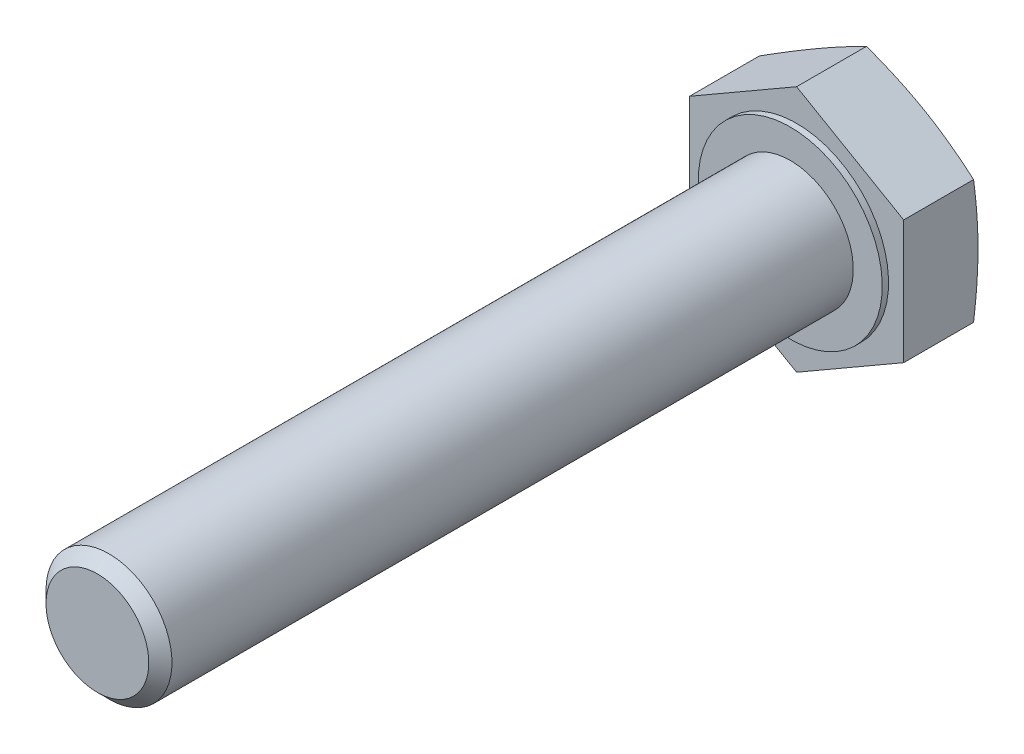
ISO-10303-21;
HEADER;
FILE_DESCRIPTION(('STEP AP214'),'2;1');
FILE_NAME('part.step','',(''),(''),'','','');
FILE_SCHEMA(('AUTOMOTIVE_DESIGN { 1 0 10303 214 1 1 1 1 }'));
ENDSEC;
DATA;
#1=APPLICATION_CONTEXT('core data for automotive mechanical design processes');
#2=APPLICATION_PROTOCOL_DEFINITION('international standard','automotive_design',2000,#1);
#3=PRODUCT_CONTEXT('',#1,'mechanical');
#4=PRODUCT('Part','Part','',(#3));
#5=PRODUCT_RELATED_PRODUCT_CATEGORY('part','',(#4));
#6=PRODUCT_DEFINITION_FORMATION('','',#4);
#7=PRODUCT_DEFINITION_CONTEXT('part definition',#1,'design');
#8=PRODUCT_DEFINITION('design','',#6,#7);
#9=PRODUCT_DEFINITION_SHAPE('','',#8);
#10=(LENGTH_UNIT() NAMED_UNIT(*) SI_UNIT(.MILLI.,.METRE.));
#11=(NAMED_UNIT(*) PLANE_ANGLE_UNIT() SI_UNIT($,.RADIAN.));
#12=(NAMED_UNIT(*) SI_UNIT($,.STERADIAN.) SOLID_ANGLE_UNIT());
#13=UNCERTAINTY_MEASURE_WITH_UNIT(LENGTH_MEASURE(1.E-05),#10,'distance_accuracy_value','');
#14=(GEOMETRIC_REPRESENTATION_CONTEXT(3) GLOBAL_UNCERTAINTY_ASSIGNED_CONTEXT((#13)) GLOBAL_UNIT_ASSIGNED_CONTEXT((#10,
#11,#12)) REPRESENTATION_CONTEXT('',''));
#15=CARTESIAN_POINT('',(0.,0.,0.));
#16=DIRECTION('',(0.,0.,1.));
#17=DIRECTION('',(1.,0.,0.));
#18=AXIS2_PLACEMENT_3D('',#15,#16,#17);
#19=CARTESIAN_POINT('',(-10.8253175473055,-6.25,5.9));
#20=DIRECTION('',(0.,0.,1.));
#21=DIRECTION('',(-0.5,0.86602540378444,0.));
#22=AXIS2_PLACEMENT_3D('',#19,#20,#21);
#23=PLANE('',#22);
#24=CARTESIAN_POINT('',(0.,0.,5.9));
#25=DIRECTION('',(0.,0.,-1.));
#26=DIRECTION('',(0.5,-0.86602540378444,0.));
#27=AXIS2_PLACEMENT_3D('',#24,#25,#26);
#28=CIRCLE('',#27,7.3);
#29=CARTESIAN_POINT('',(3.65,-6.32198544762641,5.9));
#30=VERTEX_POINT('',#29);
#31=EDGE_CURVE('E159',#30,#30,#28,.T.);
#32=ORIENTED_EDGE('',*,*,#31,.T.);
#33=EDGE_LOOP('',(#32));
#34=FACE_BOUND('',#33,.T.);
#35=DIRECTION('',(0.86602540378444,0.5,0.));
#36=VECTOR('',#35,1.);
#37=CARTESIAN_POINT('',(-6.57531754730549,-13.6112159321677,5.9));
#38=LINE('',#37,#36);
#39=CARTESIAN_POINT('',(0.,-9.81495457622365,5.9));
#40=VERTEX_POINT('',#39);
#41=CARTESIAN_POINT('',(8.5,-4.90747728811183,5.9));
#42=VERTEX_POINT('',#41);
#43=EDGE_CURVE('E161',#40,#42,#38,.T.);
#44=ORIENTED_EDGE('',*,*,#43,.T.);
#45=DIRECTION('',(0.,1.,0.));
#46=VECTOR('',#45,1.);
#47=CARTESIAN_POINT('',(8.5,-6.25,5.9));
#48=LINE('',#47,#46);
#49=CARTESIAN_POINT('',(8.5,4.90747728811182,5.9));
#50=VERTEX_POINT('',#49);
#51=EDGE_CURVE('E9',#42,#50,#48,.T.);
#52=ORIENTED_EDGE('',*,*,#51,.T.);
#53=DIRECTION('',(-0.866025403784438,0.5,0.));
#54=VECTOR('',#53,1.);
#55=CARTESIAN_POINT('',(-1.16265877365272,10.4862159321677,5.9));
#56=LINE('',#55,#54);
#57=CARTESIAN_POINT('',(0.,9.81495457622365,5.9));
#58=VERTEX_POINT('',#57);
#59=EDGE_CURVE('E22',#50,#58,#56,.T.);
#60=ORIENTED_EDGE('',*,*,#59,.T.);
#61=DIRECTION('',(-0.86602540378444,-0.5,0.));
#62=VECTOR('',#61,1.);
#63=CARTESIAN_POINT('',(-15.0753175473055,1.11121593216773,5.9));
#64=LINE('',#63,#62);
#65=CARTESIAN_POINT('',(-8.5,4.90747728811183,5.9));
#66=VERTEX_POINT('',#65);
#67=EDGE_CURVE('E175',#58,#66,#64,.T.);
#68=ORIENTED_EDGE('',*,*,#67,.T.);
#69=DIRECTION('',(0.,-1.,0.));
#70=VECTOR('',#69,1.);
#71=CARTESIAN_POINT('',(-8.5,-6.25,5.9));
#72=LINE('',#71,#70);
#73=CARTESIAN_POINT('',(-8.5,-4.90747728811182,5.9));
#74=VERTEX_POINT('',#73);
#75=EDGE_CURVE('E167',#66,#74,#72,.T.);
#76=ORIENTED_EDGE('',*,*,#75,.T.);
#77=DIRECTION('',(0.866025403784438,-0.5,0.));
#78=VECTOR('',#77,1.);
#79=CARTESIAN_POINT('',(-9.66265877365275,-4.23621593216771,5.9));
#80=LINE('',#79,#78);
#81=EDGE_CURVE('E164',#74,#40,#80,.T.);
#82=ORIENTED_EDGE('',*,*,#81,.T.);
#83=EDGE_LOOP('',(#44,#52,#60,#68,#76,#82));
#84=FACE_BOUND('',#83,.T.);
#85=ADVANCED_FACE('F14',(#34,#84),#23,.T.);
#86=CARTESIAN_POINT('',(0.,0.,61.4));
#87=DIRECTION('',(0.,0.,-1.));
#88=DIRECTION('',(0.5,-0.86602540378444,0.));
#89=AXIS2_PLACEMENT_3D('',#86,#87,#88);
#90=CYLINDRICAL_SURFACE('',#89,7.3);
#91=CARTESIAN_POINT('',(0.,0.,6.4));
#92=DIRECTION('',(0.,0.,-1.));
#93=DIRECTION('',(0.5,-0.86602540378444,0.));
#94=AXIS2_PLACEMENT_3D('',#91,#92,#93);
#95=CIRCLE('',#94,7.3);
#96=CARTESIAN_POINT('',(3.65,-6.32198544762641,6.4));
#97=VERTEX_POINT('',#96);
#98=EDGE_CURVE('E251',#97,#97,#95,.T.);
#99=ORIENTED_EDGE('',*,*,#98,.T.);
#100=EDGE_LOOP('',(#99));
#101=FACE_BOUND('',#100,.T.);
#102=ORIENTED_EDGE('',*,*,#31,.F.);
#103=EDGE_LOOP('',(#102));
#104=FACE_BOUND('',#103,.T.);
#105=ADVANCED_FACE('F147',(#101,#104),#90,.T.);
#106=CARTESIAN_POINT('',(-6.32198544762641,-3.65,6.4));
#107=DIRECTION('',(0.,0.,1.));
#108=DIRECTION('',(-0.5,0.86602540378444,0.));
#109=AXIS2_PLACEMENT_3D('',#106,#107,#108);
#110=PLANE('',#109);
#111=CARTESIAN_POINT('',(0.,0.,6.4));
#112=DIRECTION('',(0.,0.,-1.));
#113=DIRECTION('',(0.5,-0.86602540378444,0.));
#114=AXIS2_PLACEMENT_3D('',#111,#112,#113);
#115=CIRCLE('',#114,5.);
#116=CARTESIAN_POINT('',(2.5,-4.3301270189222,6.4));
#117=VERTEX_POINT('',#116);
#118=EDGE_CURVE('E253',#117,#117,#115,.T.);
#119=ORIENTED_EDGE('',*,*,#118,.T.);
#120=EDGE_LOOP('',(#119));
#121=FACE_BOUND('',#120,.T.);
#122=ORIENTED_EDGE('',*,*,#98,.F.);
#123=EDGE_LOOP('',(#122));
#124=FACE_BOUND('',#123,.T.);
#125=ADVANCED_FACE('F143',(#121,#124),#110,.T.);
#126=CARTESIAN_POINT('',(0.,0.,61.4));
#127=DIRECTION('',(0.,0.,-1.));
#128=DIRECTION('',(0.5,-0.86602540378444,0.));
#129=AXIS2_PLACEMENT_3D('',#126,#127,#128);
#130=CYLINDRICAL_SURFACE('',#129,5.);
#131=CARTESIAN_POINT('',(0.,0.,60.48));
#132=DIRECTION('',(0.,0.,-1.));
#133=DIRECTION('',(0.5,-0.86602540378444,0.));
#134=AXIS2_PLACEMENT_3D('',#131,#132,#133);
#135=CIRCLE('',#134,5.);
#136=CARTESIAN_POINT('',(2.5,-4.3301270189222,60.48));
#137=VERTEX_POINT('',#136);
#138=EDGE_CURVE('E257',#137,#137,#135,.T.);
#139=ORIENTED_EDGE('',*,*,#138,.T.);
#140=EDGE_LOOP('',(#139));
#141=FACE_BOUND('',#140,.T.);
#142=ORIENTED_EDGE('',*,*,#118,.F.);
#143=EDGE_LOOP('',(#142));
#144=FACE_BOUND('',#143,.T.);
#145=ADVANCED_FACE('F139',(#141,#144),#130,.T.);
#146=CARTESIAN_POINT('',(0.,0.,60.48));
#147=DIRECTION('',(0.,0.,-1.));
#148=DIRECTION('',(0.5,-0.86602540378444,0.));
#149=AXIS2_PLACEMENT_3D('',#146,#147,#148);
#150=CONICAL_SURFACE('',#149,5.,0.785398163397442);
#151=CARTESIAN_POINT('',(0.,0.,61.4));
#152=DIRECTION('',(0.,0.,-1.));
#153=DIRECTION('',(0.5,-0.86602540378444,0.));
#154=AXIS2_PLACEMENT_3D('',#151,#152,#153);
#155=CIRCLE('',#154,4.08);
#156=CARTESIAN_POINT('',(2.04,-3.53338364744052,61.4));
#157=VERTEX_POINT('',#156);
#158=EDGE_CURVE('E105',#157,#157,#155,.T.);
#159=ORIENTED_EDGE('',*,*,#158,.T.);
#160=EDGE_LOOP('',(#159));
#161=FACE_BOUND('',#160,.T.);
#162=ORIENTED_EDGE('',*,*,#138,.F.);
#163=EDGE_LOOP('',(#162));
#164=FACE_BOUND('',#163,.T.);
#165=ADVANCED_FACE('F135',(#161,#164),#150,.T.);
#166=CARTESIAN_POINT('',(-3.53338364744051,-2.04,61.4));
#167=DIRECTION('',(0.,0.,1.));
#168=DIRECTION('',(-0.5,0.86602540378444,0.));
#169=AXIS2_PLACEMENT_3D('',#166,#167,#168);
#170=PLANE('',#169);
#171=ORIENTED_EDGE('',*,*,#158,.F.);
#172=EDGE_LOOP('',(#171));
#173=FACE_BOUND('',#172,.T.);
#174=ADVANCED_FACE('F130',(#173),#170,.T.);
#175=CARTESIAN_POINT('',(8.5,-4.90747728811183,0.));
#176=DIRECTION('',(1.,0.,0.));
#177=DIRECTION('',(0.,1.,0.));
#178=AXIS2_PLACEMENT_3D('',#175,#176,#177);
#179=PLANE('',#178);
#180=DIRECTION('',(0.,0.,1.));
#181=VECTOR('',#180,1.);
#182=CARTESIAN_POINT('',(8.5,4.90747728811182,0.));
#183=LINE('',#182,#181);
#184=CARTESIAN_POINT('',(8.5,4.90747728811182,0.352341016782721));
#185=VERTEX_POINT('',#184);
#186=EDGE_CURVE('E180',#185,#50,#183,.T.);
#187=ORIENTED_EDGE('',*,*,#186,.T.);
#188=ORIENTED_EDGE('',*,*,#51,.F.);
#189=DIRECTION('',(0.,0.,1.));
#190=VECTOR('',#189,1.);
#191=CARTESIAN_POINT('',(8.5,-4.90747728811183,0.));
#192=LINE('',#191,#190);
#193=CARTESIAN_POINT('',(8.5,-4.90747728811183,0.35234101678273));
#194=VERTEX_POINT('',#193);
#195=EDGE_CURVE('E35',#194,#42,#192,.T.);
#196=ORIENTED_EDGE('',*,*,#195,.F.);
#197=CARTESIAN_POINT('',(8.5,4.90770822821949,0.35237195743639));
#198=CARTESIAN_POINT('',(8.50000000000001,4.50009867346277,0.29774004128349));
#199=CARTESIAN_POINT('',(8.50000000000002,4.09175008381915,0.248143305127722));
#200=CARTESIAN_POINT('',(8.50000000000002,3.27361081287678,0.161006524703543));
#201=CARTESIAN_POINT('',(8.50000000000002,2.8638196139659,0.123471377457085));
#202=CARTESIAN_POINT('',(8.50000000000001,2.04527964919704,0.0626490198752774));
#203=CARTESIAN_POINT('',(8.50000000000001,1.63653641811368,0.039289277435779));
#204=CARTESIAN_POINT('',(8.50000000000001,0.818528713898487,0.00796625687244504));
#205=CARTESIAN_POINT('',(8.50000000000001,0.409264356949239,0.));
#206=CARTESIAN_POINT('',(8.50000000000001,-0.409264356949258,0.));
#207=CARTESIAN_POINT('',(8.50000000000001,-0.818528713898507,0.00796625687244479));
#208=CARTESIAN_POINT('',(8.50000000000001,-1.6365364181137,0.0392892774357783));
#209=CARTESIAN_POINT('',(8.50000000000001,-2.04527964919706,0.0626490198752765));
#210=CARTESIAN_POINT('',(8.5,-2.86381961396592,0.123471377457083));
#211=CARTESIAN_POINT('',(8.5,-3.2736108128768,0.16100652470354));
#212=CARTESIAN_POINT('',(8.5,-4.09175008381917,0.248143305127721));
#213=CARTESIAN_POINT('',(8.5,-4.50009867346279,0.297740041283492));
#214=CARTESIAN_POINT('',(8.5,-4.90770822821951,0.3523719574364));
#215=B_SPLINE_CURVE_WITH_KNOTS('',3,(#197,#198,#199,#200,#201,#202,#203,#204,#205,#206,#207,
#208,#209,#210,#211,#212,#213,#214),.UNSPECIFIED.,.F.,.F.,(4,2,2,2,2,2,2,2,4),(0.,
1.23382789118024,2.46815608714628,3.69611406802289,4.92383440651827,6.15155474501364,
7.37951272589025,8.61384092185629,9.84766881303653),.UNSPECIFIED.);
#216=CARTESIAN_POINT('',(8.5,0.,0.));
#217=VERTEX_POINT('',#216);
#218=EDGE_CURVE('E95',#217,#194,#215,.T.);
#219=ORIENTED_EDGE('',*,*,#218,.F.);
#220=EDGE_CURVE('E102',#185,#217,#215,.T.);
#221=ORIENTED_EDGE('',*,*,#220,.F.);
#222=EDGE_LOOP('',(#187,#188,#196,#219,#221));
#223=FACE_BOUND('',#222,.T.);
#224=ADVANCED_FACE('F94',(#223),#179,.T.);
#225=CARTESIAN_POINT('',(8.5,4.90747728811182,0.));
#226=DIRECTION('',(0.5,0.866025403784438,0.));
#227=DIRECTION('',(-0.866025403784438,0.5,0.));
#228=AXIS2_PLACEMENT_3D('',#225,#226,#227);
#229=PLANE('',#228);
#230=DIRECTION('',(0.,0.,1.));
#231=VECTOR('',#230,1.);
#232=CARTESIAN_POINT('',(0.,9.81495457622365,0.));
#233=LINE('',#232,#231);
#234=CARTESIAN_POINT('',(0.,9.81495457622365,0.35234101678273));
#235=VERTEX_POINT('',#234);
#236=EDGE_CURVE('E183',#235,#58,#233,.T.);
#237=ORIENTED_EDGE('',*,*,#236,.T.);
#238=ORIENTED_EDGE('',*,*,#59,.F.);
#239=ORIENTED_EDGE('',*,*,#186,.F.);
#240=CARTESIAN_POINT('',(-0.000200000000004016,9.81507004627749,0.3523719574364));
#241=CARTESIAN_POINT('',(0.352800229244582,9.61126526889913,0.297740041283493));
#242=CARTESIAN_POINT('',(0.706440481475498,9.40709097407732,0.248143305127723));
#243=CARTESIAN_POINT('',(1.41496987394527,8.99802133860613,0.161006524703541));
#244=CARTESIAN_POINT('',(1.76985946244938,8.79312573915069,0.123471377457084));
#245=CARTESIAN_POINT('',(2.47873586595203,8.38385575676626,0.0626490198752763));
#246=CARTESIAN_POINT('',(2.83271788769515,8.17948414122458,0.0392892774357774));
#247=CARTESIAN_POINT('',(3.54113334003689,7.77048028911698,0.00796625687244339));
#248=CARTESIAN_POINT('',(3.89556667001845,7.56584811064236,0.));
#249=CARTESIAN_POINT('',(4.60443332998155,7.15658375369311,0.));
#250=CARTESIAN_POINT('',(4.9588666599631,6.95195157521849,0.00796625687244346));
#251=CARTESIAN_POINT('',(5.66728211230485,6.54294772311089,0.0392892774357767));
#252=CARTESIAN_POINT('',(6.02126413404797,6.33857610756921,0.0626490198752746));
#253=CARTESIAN_POINT('',(6.73014053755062,5.92930612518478,0.123471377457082));
#254=CARTESIAN_POINT('',(7.08503012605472,5.72441052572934,0.16100652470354));
#255=CARTESIAN_POINT('',(7.79355951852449,5.31534089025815,0.248143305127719));
#256=CARTESIAN_POINT('',(8.14719977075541,5.11116659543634,0.297740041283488));
#257=CARTESIAN_POINT('',(8.5002,4.90736181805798,0.35237195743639));
#258=B_SPLINE_CURVE_WITH_KNOTS('',3,(#240,#241,#242,#243,#244,#245,#246,#247,#248,#249,#250,
#251,#252,#253,#254,#255,#256,#257),.UNSPECIFIED.,.F.,.F.,(4,2,2,2,2,2,2,2,4),(0.,
1.23382789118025,2.46815608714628,3.69611406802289,4.92383440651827,6.15155474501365,
7.37951272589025,8.61384092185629,9.84766881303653),.UNSPECIFIED.);
#259=CARTESIAN_POINT('',(4.25,7.36121593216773,0.));
#260=VERTEX_POINT('',#259);
#261=EDGE_CURVE('E107',#260,#185,#258,.T.);
#262=ORIENTED_EDGE('',*,*,#261,.F.);
#263=EDGE_CURVE('E103',#235,#260,#258,.T.);
#264=ORIENTED_EDGE('',*,*,#263,.F.);
#265=EDGE_LOOP('',(#237,#238,#239,#262,#264));
#266=FACE_BOUND('',#265,.T.);
#267=ADVANCED_FACE('F129',(#266),#229,.T.);
#268=CARTESIAN_POINT('',(0.,9.81495457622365,0.));
#269=DIRECTION('',(-0.5,0.86602540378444,0.));
#270=DIRECTION('',(-0.86602540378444,-0.5,0.));
#271=AXIS2_PLACEMENT_3D('',#268,#269,#270);
#272=PLANE('',#271);
#273=DIRECTION('',(0.,0.,1.));
#274=VECTOR('',#273,1.);
#275=CARTESIAN_POINT('',(-8.5,4.90747728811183,0.));
#276=LINE('',#275,#274);
#277=CARTESIAN_POINT('',(-8.5,4.90747728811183,0.35234101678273));
#278=VERTEX_POINT('',#277);
#279=EDGE_CURVE('E185',#278,#66,#276,.T.);
#280=ORIENTED_EDGE('',*,*,#279,.T.);
#281=ORIENTED_EDGE('',*,*,#67,.F.);
#282=ORIENTED_EDGE('',*,*,#236,.F.);
#283=CARTESIAN_POINT('',(7.0313185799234,13.8744882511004,1.89023375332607));
#284=CARTESIAN_POINT('',(6.69691797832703,13.6814219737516,1.8036079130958));
#285=CARTESIAN_POINT('',(6.36230928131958,13.4882355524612,1.71803410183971));
#286=CARTESIAN_POINT('',(5.69257341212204,13.101563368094,1.54955847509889));
#287=CARTESIAN_POINT('',(5.35744621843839,12.908077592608,1.46665677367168));
#288=CARTESIAN_POINT('',(4.68627637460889,12.5205775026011,1.30402247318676));
#289=CARTESIAN_POINT('',(4.35023315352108,12.3265628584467,1.22429300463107));
#290=CARTESIAN_POINT('',(3.67745005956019,11.9381313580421,1.06885664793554));
#291=CARTESIAN_POINT('',(3.34071019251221,11.7437145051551,0.993149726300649));
#292=CARTESIAN_POINT('',(2.66909613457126,11.3559579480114,0.847300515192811));
#293=CARTESIAN_POINT('',(2.33422840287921,11.162621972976,0.777118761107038));
#294=CARTESIAN_POINT('',(1.66358167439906,10.7754239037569,0.642833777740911));
#295=CARTESIAN_POINT('',(1.32780269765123,10.5815618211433,0.578730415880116));
#296=CARTESIAN_POINT('',(0.655263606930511,10.1932711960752,0.458036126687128));
#297=CARTESIAN_POINT('',(0.318503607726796,9.99884271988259,0.4014443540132));
#298=CARTESIAN_POINT('',(-0.356089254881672,9.60936634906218,0.297432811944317));
#299=CARTESIAN_POINT('',(-0.693922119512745,9.41431845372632,0.250013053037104));
#300=CARTESIAN_POINT('',(-1.37448875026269,9.02139312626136,0.165678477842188));
#301=CARTESIAN_POINT('',(-1.71723441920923,8.82350882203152,0.128889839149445));
#302=CARTESIAN_POINT('',(-2.40359571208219,8.42723794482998,0.068349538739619));
#303=CARTESIAN_POINT('',(-2.74721131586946,8.22885138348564,0.044597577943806));
#304=CARTESIAN_POINT('',(-3.43481274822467,7.83186451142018,0.0115154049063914));
#305=CARTESIAN_POINT('',(-3.77879832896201,7.63326434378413,0.0021784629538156));
#306=CARTESIAN_POINT('',(-4.46683038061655,7.2360288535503,-0.00149860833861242));
#307=CARTESIAN_POINT('',(-4.81087685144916,7.03739353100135,0.00416124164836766));
#308=CARTESIAN_POINT('',(-5.49980565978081,6.63964029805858,0.0301600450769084));
#309=CARTESIAN_POINT('',(-5.84468644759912,6.44052328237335,0.0505526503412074));
#310=CARTESIAN_POINT('',(-6.53364206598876,6.04275457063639,0.104849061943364));
#311=CARTESIAN_POINT('',(-6.87771687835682,5.84410288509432,0.13875317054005));
#312=CARTESIAN_POINT('',(-7.56505695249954,5.4472669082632,0.218348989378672));
#313=CARTESIAN_POINT('',(-7.90832152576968,5.24908301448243,0.264048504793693));
#314=CARTESIAN_POINT('',(-8.59374440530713,4.85335393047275,0.365319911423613));
#315=CARTESIAN_POINT('',(-8.93590270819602,4.65580874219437,0.420891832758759));
#316=CARTESIAN_POINT('',(-9.60036756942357,4.27217977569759,0.536839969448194));
#317=CARTESIAN_POINT('',(-9.92273125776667,4.08606301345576,0.596784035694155));
#318=CARTESIAN_POINT('',(-10.5665974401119,3.71432669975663,0.722578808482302));
#319=CARTESIAN_POINT('',(-10.8880999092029,3.52870716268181,0.788429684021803));
#320=CARTESIAN_POINT('',(-11.5303683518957,3.15789330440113,0.924946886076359));
#321=CARTESIAN_POINT('',(-11.8511342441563,2.97269903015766,0.995613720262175));
#322=CARTESIAN_POINT('',(-12.4919945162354,2.60269817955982,1.14086451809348));
#323=CARTESIAN_POINT('',(-12.8120889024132,2.41789159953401,1.21544844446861));
#324=CARTESIAN_POINT('',(-13.4517854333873,2.04856263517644,1.367836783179));
#325=CARTESIAN_POINT('',(-13.7713874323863,1.86404033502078,1.44564200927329));
#326=CARTESIAN_POINT('',(-14.4101022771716,1.49527814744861,1.60388879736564));
#327=CARTESIAN_POINT('',(-14.7292151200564,1.31103826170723,1.68433037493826));
#328=CARTESIAN_POINT('',(-15.6858858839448,0.758704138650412,1.92889027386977));
#329=CARTESIAN_POINT('',(-16.3228211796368,0.390969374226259,2.0962546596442));
#330=CARTESIAN_POINT('',(-17.5891530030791,-0.340147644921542,2.43530526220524));
#331=CARTESIAN_POINT('',(-18.2185615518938,-0.703536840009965,2.60693200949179));
#332=CARTESIAN_POINT('',(-19.4765047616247,-1.42981069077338,2.95445699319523));
#333=CARTESIAN_POINT('',(-20.1050394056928,-1.79269533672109,3.13035531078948));
#334=CARTESIAN_POINT('',(-21.3606408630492,-2.5176171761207,3.48507030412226));
#335=CARTESIAN_POINT('',(-21.9877085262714,-2.87965486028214,3.66388297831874));
#336=CARTESIAN_POINT('',(-23.2413014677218,-3.60341708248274,4.02392378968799));
#337=CARTESIAN_POINT('',(-23.8678267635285,-3.96514163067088,4.2051518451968));
#338=CARTESIAN_POINT('',(-24.4941639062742,-4.32675754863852,4.38723321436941));
#339=B_SPLINE_CURVE_WITH_KNOTS('',3,(#283,#284,#285,#286,#287,#288,#289,#290,#291,#292,#293,
#294,#295,#296,#297,#298,#299,#300,#301,#302,#303,#304,#305,#306,#307,#308,#309,#310,#311,#312,
#313,#314,#315,#316,#317,#318,#319,#320,#321,#322,#323,#324,#325,#326,#327,#328,#329,#330,#331,
#332,#333,#334,#335,#336,#337,#338),.UNSPECIFIED.,.F.,.F.,(4,2,2,2,2,2,2,2,2,2,2,2,2,2,2,2,2,2,
2,2,2,2,2,2,2,2,2,4),(0.,1.18719535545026,2.37444131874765,3.56283123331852,4.75121125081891,
5.93014074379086,7.10904451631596,8.28781550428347,9.46658784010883,10.6588244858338,
11.8510337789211,13.0426863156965,14.2343372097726,15.4303497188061,16.6263889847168,
17.82322172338,19.0200581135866,20.1510895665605,21.2821533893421,22.4133366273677,
23.5445091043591,24.6759691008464,25.8074357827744,28.0702094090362,30.3104986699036,
32.5508305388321,34.7883095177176,37.0257130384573),.UNSPECIFIED.);
#340=CARTESIAN_POINT('',(-4.25,7.36121593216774,0.));
#341=VERTEX_POINT('',#340);
#342=EDGE_CURVE('E221',#341,#235,#339,.F.);
#343=ORIENTED_EDGE('',*,*,#342,.F.);
#344=EDGE_CURVE('E227',#278,#341,#339,.F.);
#345=ORIENTED_EDGE('',*,*,#344,.F.);
#346=EDGE_LOOP('',(#280,#281,#282,#343,#345));
#347=FACE_BOUND('',#346,.T.);
#348=ADVANCED_FACE('F215',(#347),#272,.T.);
#349=CARTESIAN_POINT('',(-8.5,4.90747728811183,0.));
#350=DIRECTION('',(-1.,0.,0.));
#351=DIRECTION('',(0.,-1.,0.));
#352=AXIS2_PLACEMENT_3D('',#349,#350,#351);
#353=PLANE('',#352);
#354=DIRECTION('',(0.,0.,1.));
#355=VECTOR('',#354,1.);
#356=CARTESIAN_POINT('',(-8.5,-4.90747728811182,0.));
#357=LINE('',#356,#355);
#358=CARTESIAN_POINT('',(-8.5,-4.90747728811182,0.352341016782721));
#359=VERTEX_POINT('',#358);
#360=EDGE_CURVE('E596',#359,#74,#357,.T.);
#361=ORIENTED_EDGE('',*,*,#360,.T.);
#362=ORIENTED_EDGE('',*,*,#75,.F.);
#363=ORIENTED_EDGE('',*,*,#279,.F.);
#364=CARTESIAN_POINT('',(-8.5,-4.90770822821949,0.35237195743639));
#365=CARTESIAN_POINT('',(-8.50000000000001,-4.50009867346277,0.29774004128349));
#366=CARTESIAN_POINT('',(-8.50000000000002,-4.09175008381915,0.248143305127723));
#367=CARTESIAN_POINT('',(-8.50000000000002,-3.27361081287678,0.161006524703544));
#368=CARTESIAN_POINT('',(-8.50000000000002,-2.8638196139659,0.123471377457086));
#369=CARTESIAN_POINT('',(-8.50000000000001,-2.04527964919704,0.0626490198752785));
#370=CARTESIAN_POINT('',(-8.50000000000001,-1.63653641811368,0.0392892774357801));
#371=CARTESIAN_POINT('',(-8.50000000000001,-0.818528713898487,0.00796625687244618));
#372=CARTESIAN_POINT('',(-8.50000000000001,-0.409264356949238,0.));
#373=CARTESIAN_POINT('',(-8.50000000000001,0.409264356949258,0.));
#374=CARTESIAN_POINT('',(-8.50000000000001,0.818528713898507,0.00796625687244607));
#375=CARTESIAN_POINT('',(-8.50000000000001,1.6365364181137,0.0392892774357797));
#376=CARTESIAN_POINT('',(-8.50000000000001,2.04527964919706,0.0626490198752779));
#377=CARTESIAN_POINT('',(-8.5,2.86381961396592,0.123471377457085));
#378=CARTESIAN_POINT('',(-8.5,3.2736108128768,0.161006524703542));
#379=CARTESIAN_POINT('',(-8.5,4.09175008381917,0.248143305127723));
#380=CARTESIAN_POINT('',(-8.5,4.50009867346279,0.297740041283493));
#381=CARTESIAN_POINT('',(-8.5,4.90770822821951,0.3523719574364));
#382=B_SPLINE_CURVE_WITH_KNOTS('',3,(#364,#365,#366,#367,#368,#369,#370,#371,#372,#373,#374,
#375,#376,#377,#378,#379,#380,#381),.UNSPECIFIED.,.F.,.F.,(4,2,2,2,2,2,2,2,4),(0.,
1.23382789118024,2.46815608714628,3.69611406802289,4.92383440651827,6.15155474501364,
7.37951272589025,8.61384092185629,9.84766881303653),.UNSPECIFIED.);
#383=CARTESIAN_POINT('',(-8.5,0.,0.));
#384=VERTEX_POINT('',#383);
#385=EDGE_CURVE('E201',#384,#278,#382,.T.);
#386=ORIENTED_EDGE('',*,*,#385,.F.);
#387=EDGE_CURVE('E228',#359,#384,#382,.T.);
#388=ORIENTED_EDGE('',*,*,#387,.F.);
#389=EDGE_LOOP('',(#361,#362,#363,#386,#388));
#390=FACE_BOUND('',#389,.T.);
#391=ADVANCED_FACE('F210',(#390),#353,.T.);
#392=CARTESIAN_POINT('',(-8.5,-4.90747728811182,0.));
#393=DIRECTION('',(-0.5,-0.866025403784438,0.));
#394=DIRECTION('',(0.866025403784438,-0.5,0.));
#395=AXIS2_PLACEMENT_3D('',#392,#393,#394);
#396=PLANE('',#395);
#397=DIRECTION('',(0.,0.,1.));
#398=VECTOR('',#397,1.);
#399=CARTESIAN_POINT('',(0.,-9.81495457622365,0.));
#400=LINE('',#399,#398);
#401=CARTESIAN_POINT('',(0.,-9.81495457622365,0.35234101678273));
#402=VERTEX_POINT('',#401);
#403=EDGE_CURVE('E29',#402,#40,#400,.T.);
#404=ORIENTED_EDGE('',*,*,#403,.T.);
#405=ORIENTED_EDGE('',*,*,#81,.F.);
#406=ORIENTED_EDGE('',*,*,#360,.F.);
#407=CARTESIAN_POINT('',(0.000200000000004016,-9.81507004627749,0.3523719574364));
#408=CARTESIAN_POINT('',(-0.35280022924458,-9.61126526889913,0.297740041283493));
#409=CARTESIAN_POINT('',(-0.706440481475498,-9.40709097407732,0.248143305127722));
#410=CARTESIAN_POINT('',(-1.41496987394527,-8.99802133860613,0.161006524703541));
#411=CARTESIAN_POINT('',(-1.76985946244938,-8.79312573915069,0.123471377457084));
#412=CARTESIAN_POINT('',(-2.47873586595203,-8.38385575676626,0.062649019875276));
#413=CARTESIAN_POINT('',(-2.83271788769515,-8.17948414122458,0.0392892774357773));
#414=CARTESIAN_POINT('',(-3.54113334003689,-7.77048028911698,0.00796625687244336));
#415=CARTESIAN_POINT('',(-3.89556667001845,-7.56584811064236,0.));
#416=CARTESIAN_POINT('',(-4.60443332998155,-7.15658375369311,0.));
#417=CARTESIAN_POINT('',(-4.9588666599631,-6.95195157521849,0.00796625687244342));
#418=CARTESIAN_POINT('',(-5.66728211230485,-6.54294772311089,0.0392892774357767));
#419=CARTESIAN_POINT('',(-6.02126413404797,-6.33857610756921,0.0626490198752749));
#420=CARTESIAN_POINT('',(-6.73014053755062,-5.92930612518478,0.123471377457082));
#421=CARTESIAN_POINT('',(-7.08503012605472,-5.72441052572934,0.16100652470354));
#422=CARTESIAN_POINT('',(-7.79355951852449,-5.31534089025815,0.24814330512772));
#423=CARTESIAN_POINT('',(-8.14719977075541,-5.11116659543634,0.297740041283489));
#424=CARTESIAN_POINT('',(-8.5002,-4.90736181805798,0.35237195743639));
#425=B_SPLINE_CURVE_WITH_KNOTS('',3,(#407,#408,#409,#410,#411,#412,#413,#414,#415,#416,#417,
#418,#419,#420,#421,#422,#423,#424),.UNSPECIFIED.,.F.,.F.,(4,2,2,2,2,2,2,2,4),(0.,
1.23382789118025,2.46815608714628,3.69611406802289,4.92383440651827,6.15155474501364,
7.37951272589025,8.61384092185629,9.84766881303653),.UNSPECIFIED.);
#426=CARTESIAN_POINT('',(-4.25,-7.36121593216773,0.));
#427=VERTEX_POINT('',#426);
#428=EDGE_CURVE('E90',#427,#359,#425,.T.);
#429=ORIENTED_EDGE('',*,*,#428,.F.);
#430=EDGE_CURVE('E200',#402,#427,#425,.T.);
#431=ORIENTED_EDGE('',*,*,#430,.F.);
#432=EDGE_LOOP('',(#404,#405,#406,#429,#431));
#433=FACE_BOUND('',#432,.T.);
#434=ADVANCED_FACE('F207',(#433),#396,.T.);
#435=CARTESIAN_POINT('',(0.,-9.81495457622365,0.));
#436=DIRECTION('',(0.5,-0.86602540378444,0.));
#437=DIRECTION('',(0.86602540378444,0.5,0.));
#438=AXIS2_PLACEMENT_3D('',#435,#436,#437);
#439=PLANE('',#438);
#440=ORIENTED_EDGE('',*,*,#195,.T.);
#441=ORIENTED_EDGE('',*,*,#43,.F.);
#442=ORIENTED_EDGE('',*,*,#403,.F.);
#443=CARTESIAN_POINT('',(15.5313185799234,-0.847943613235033,1.89023375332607));
#444=CARTESIAN_POINT('',(15.196917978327,-1.04100989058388,1.8036079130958));
#445=CARTESIAN_POINT('',(14.8623092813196,-1.23419631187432,1.71803410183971));
#446=CARTESIAN_POINT('',(14.1925734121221,-1.62086849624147,1.54955847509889));
#447=CARTESIAN_POINT('',(13.8574462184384,-1.81435427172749,1.46665677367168));
#448=CARTESIAN_POINT('',(13.1862763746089,-2.20185436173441,1.30402247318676));
#449=CARTESIAN_POINT('',(12.8502331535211,-2.3958690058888,1.22429300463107));
#450=CARTESIAN_POINT('',(12.1774500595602,-2.78430050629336,1.06885664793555));
#451=CARTESIAN_POINT('',(11.8407101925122,-2.97871735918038,0.993149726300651));
#452=CARTESIAN_POINT('',(11.1690961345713,-3.36647391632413,0.847300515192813));
#453=CARTESIAN_POINT('',(10.8342284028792,-3.55980989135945,0.77711876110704));
#454=CARTESIAN_POINT('',(10.1635816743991,-3.94700796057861,0.642833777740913));
#455=CARTESIAN_POINT('',(9.82780269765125,-4.14087004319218,0.578730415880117));
#456=CARTESIAN_POINT('',(9.15526360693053,-4.52916066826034,0.458036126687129));
#457=CARTESIAN_POINT('',(8.81850360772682,-4.7235891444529,0.4014443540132));
#458=CARTESIAN_POINT('',(8.14391074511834,-5.11306551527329,0.297432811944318));
#459=CARTESIAN_POINT('',(7.80607788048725,-5.30811341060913,0.250013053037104));
#460=CARTESIAN_POINT('',(7.12551124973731,-5.70103873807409,0.165678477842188));
#461=CARTESIAN_POINT('',(6.78276558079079,-5.89892304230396,0.128889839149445));
#462=CARTESIAN_POINT('',(6.09640428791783,-6.29519391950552,0.0683495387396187));
#463=CARTESIAN_POINT('',(5.75278868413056,-6.49358048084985,0.0445975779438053));
#464=CARTESIAN_POINT('',(5.06518725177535,-6.8905673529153,0.0115154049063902));
#465=CARTESIAN_POINT('',(4.72120167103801,-7.08916752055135,0.00217846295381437));
#466=CARTESIAN_POINT('',(4.03316961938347,-7.48640301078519,-0.00149860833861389));
#467=CARTESIAN_POINT('',(3.68912314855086,-7.68503833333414,0.00416124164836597));
#468=CARTESIAN_POINT('',(3.00019434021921,-8.0827915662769,0.0301600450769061));
#469=CARTESIAN_POINT('',(2.6553135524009,-8.28190858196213,0.0505526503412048));
#470=CARTESIAN_POINT('',(1.96635793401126,-8.6796772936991,0.104849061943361));
#471=CARTESIAN_POINT('',(1.6222831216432,-8.87832897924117,0.138753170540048));
#472=CARTESIAN_POINT('',(0.934943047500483,-9.27516495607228,0.218348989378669));
#473=CARTESIAN_POINT('',(0.59167847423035,-9.47334884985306,0.264048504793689));
#474=CARTESIAN_POINT('',(-0.0937444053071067,-9.86907793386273,0.36531991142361));
#475=CARTESIAN_POINT('',(-0.435902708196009,-10.0666231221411,0.420891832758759));
#476=CARTESIAN_POINT('',(-1.10036756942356,-10.4502520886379,0.536839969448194));
#477=CARTESIAN_POINT('',(-1.42273125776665,-10.6363688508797,0.596784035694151));
#478=CARTESIAN_POINT('',(-2.06659744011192,-11.0081051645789,0.722578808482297));
#479=CARTESIAN_POINT('',(-2.38809990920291,-11.1937247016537,0.788429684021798));
#480=CARTESIAN_POINT('',(-3.0303683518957,-11.5645385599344,0.924946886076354));
#481=CARTESIAN_POINT('',(-3.35113424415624,-11.7497328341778,0.99561372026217));
#482=CARTESIAN_POINT('',(-3.9919945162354,-12.1197336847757,1.14086451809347));
#483=CARTESIAN_POINT('',(-4.31208890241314,-12.3045402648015,1.2154484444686));
#484=CARTESIAN_POINT('',(-4.95178543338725,-12.673869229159,1.367836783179));
#485=CARTESIAN_POINT('',(-5.27138743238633,-12.8583915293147,1.44564200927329));
#486=CARTESIAN_POINT('',(-5.91010227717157,-13.2271537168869,1.60388879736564));
#487=CARTESIAN_POINT('',(-6.22921512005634,-13.4113936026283,1.68433037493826));
#488=CARTESIAN_POINT('',(-7.18588588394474,-13.9637277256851,1.92889027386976));
#489=CARTESIAN_POINT('',(-7.82282117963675,-14.3314624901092,2.0962546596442));
#490=CARTESIAN_POINT('',(-9.08915300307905,-15.062579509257,2.43530526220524));
#491=CARTESIAN_POINT('',(-9.71856155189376,-15.4259687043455,2.60693200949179));
#492=CARTESIAN_POINT('',(-10.9765047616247,-16.1522425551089,2.95445699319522));
#493=CARTESIAN_POINT('',(-11.6050394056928,-16.5151272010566,3.13035531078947));
#494=CARTESIAN_POINT('',(-12.8606408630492,-17.2400490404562,3.48507030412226));
#495=CARTESIAN_POINT('',(-13.4877085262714,-17.6020867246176,3.66388297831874));
#496=CARTESIAN_POINT('',(-14.7413014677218,-18.3258489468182,4.02392378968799));
#497=CARTESIAN_POINT('',(-15.3678267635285,-18.6875734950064,4.2051518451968));
#498=CARTESIAN_POINT('',(-15.9941639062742,-19.049189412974,4.38723321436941));
#499=B_SPLINE_CURVE_WITH_KNOTS('',3,(#443,#444,#445,#446,#447,#448,#449,#450,#451,#452,#453,
#454,#455,#456,#457,#458,#459,#460,#461,#462,#463,#464,#465,#466,#467,#468,#469,#470,#471,#472,
#473,#474,#475,#476,#477,#478,#479,#480,#481,#482,#483,#484,#485,#486,#487,#488,#489,#490,#491,
#492,#493,#494,#495,#496,#497,#498),.UNSPECIFIED.,.F.,.F.,(4,2,2,2,2,2,2,2,2,2,2,2,2,2,2,2,2,2,
2,2,2,2,2,2,2,2,2,4),(0.,1.18719535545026,2.37444131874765,3.56283123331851,4.75121125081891,
5.93014074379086,7.10904451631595,8.28781550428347,9.46658784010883,10.6588244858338,
11.8510337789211,13.0426863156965,14.2343372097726,15.4303497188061,16.6263889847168,
17.82322172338,19.0200581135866,20.1510895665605,21.2821533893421,22.4133366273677,
23.5445091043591,24.6759691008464,25.8074357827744,28.0702094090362,30.3104986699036,
32.5508305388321,34.7883095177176,37.0257130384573),.UNSPECIFIED.);
#500=CARTESIAN_POINT('',(4.25,-7.36121593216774,0.));
#501=VERTEX_POINT('',#500);
#502=EDGE_CURVE('E85',#501,#402,#499,.T.);
#503=ORIENTED_EDGE('',*,*,#502,.F.);
#504=EDGE_CURVE('E82',#194,#501,#499,.T.);
#505=ORIENTED_EDGE('',*,*,#504,.F.);
#506=EDGE_LOOP('',(#440,#441,#442,#503,#505));
#507=FACE_BOUND('',#506,.T.);
#508=ADVANCED_FACE('F83',(#507),#439,.T.);
#509=CARTESIAN_POINT('',(0.,0.,0.));
#510=DIRECTION('',(0.,0.,1.));
#511=DIRECTION('',(-0.5,0.86602540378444,0.));
#512=AXIS2_PLACEMENT_3D('',#509,#510,#511);
#513=CONICAL_SURFACE('',#512,8.5,1.30899693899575);
#514=CARTESIAN_POINT('',(0.,0.,0.));
#515=DIRECTION('',(0.,0.,-1.));
#516=DIRECTION('',(0.5,-0.86602540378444,0.));
#517=AXIS2_PLACEMENT_3D('',#514,#515,#516);
#518=CIRCLE('',#517,8.5);
#519=EDGE_CURVE('E100',#217,#501,#518,.T.);
#520=ORIENTED_EDGE('',*,*,#519,.F.);
#521=ORIENTED_EDGE('',*,*,#218,.T.);
#522=ORIENTED_EDGE('',*,*,#504,.T.);
#523=EDGE_LOOP('',(#520,#521,#522));
#524=FACE_BOUND('',#523,.T.);
#525=ADVANCED_FACE('F99',(#524),#513,.T.);
#526=EDGE_CURVE('E249',#260,#217,#518,.T.);
#527=ORIENTED_EDGE('',*,*,#526,.F.);
#528=ORIENTED_EDGE('',*,*,#261,.T.);
#529=ORIENTED_EDGE('',*,*,#220,.T.);
#530=EDGE_LOOP('',(#527,#528,#529));
#531=FACE_BOUND('',#530,.T.);
#532=ADVANCED_FACE('F272',(#531),#513,.T.);
#533=EDGE_CURVE('E250',#341,#260,#518,.T.);
#534=ORIENTED_EDGE('',*,*,#533,.F.);
#535=ORIENTED_EDGE('',*,*,#342,.T.);
#536=ORIENTED_EDGE('',*,*,#263,.T.);
#537=EDGE_LOOP('',(#534,#535,#536));
#538=FACE_BOUND('',#537,.T.);
#539=ADVANCED_FACE('F270',(#538),#513,.T.);
#540=ORIENTED_EDGE('',*,*,#385,.T.);
#541=ORIENTED_EDGE('',*,*,#344,.T.);
#542=EDGE_CURVE('E246',#384,#341,#518,.T.);
#543=ORIENTED_EDGE('',*,*,#542,.F.);
#544=EDGE_LOOP('',(#540,#541,#543));
#545=FACE_BOUND('',#544,.T.);
#546=ADVANCED_FACE('F122',(#545),#513,.T.);
#547=ORIENTED_EDGE('',*,*,#428,.T.);
#548=ORIENTED_EDGE('',*,*,#387,.T.);
#549=EDGE_CURVE('E170',#427,#384,#518,.T.);
#550=ORIENTED_EDGE('',*,*,#549,.F.);
#551=EDGE_LOOP('',(#547,#548,#550));
#552=FACE_BOUND('',#551,.T.);
#553=ADVANCED_FACE('F243',(#552),#513,.T.);
#554=CARTESIAN_POINT('',(0.,0.,0.));
#555=DIRECTION('',(0.,0.,-1.));
#556=DIRECTION('',(0.5,-0.86602540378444,0.));
#557=AXIS2_PLACEMENT_3D('',#554,#555,#556);
#558=PLANE('',#557);
#559=EDGE_CURVE('E165',#501,#427,#518,.T.);
#560=ORIENTED_EDGE('',*,*,#559,.T.);
#561=ORIENTED_EDGE('',*,*,#549,.T.);
#562=ORIENTED_EDGE('',*,*,#542,.T.);
#563=ORIENTED_EDGE('',*,*,#533,.T.);
#564=ORIENTED_EDGE('',*,*,#526,.T.);
#565=ORIENTED_EDGE('',*,*,#519,.T.);
#566=EDGE_LOOP('',(#560,#561,#562,#563,#564,#565));
#567=FACE_BOUND('',#566,.T.);
#568=ADVANCED_FACE('F16',(#567),#558,.T.);
#569=ORIENTED_EDGE('',*,*,#502,.T.);
#570=ORIENTED_EDGE('',*,*,#430,.T.);
#571=ORIENTED_EDGE('',*,*,#559,.F.);
#572=EDGE_LOOP('',(#569,#570,#571));
#573=FACE_BOUND('',#572,.T.);
#574=ADVANCED_FACE('F241',(#573),#513,.T.);
#575=CLOSED_SHELL('',(#85,#105,#125,#145,#165,#174,#224,#267,#348,#391,#434,#508,#525,#532,#539,
#546,#553,#568,#574));
#576=MANIFOLD_SOLID_BREP('B1',#575);
#577=ADVANCED_BREP_SHAPE_REPRESENTATION('',(#18,#576),#14);
#578=SHAPE_DEFINITION_REPRESENTATION(#9,#577);
ENDSEC;
END-ISO-10303-21;
